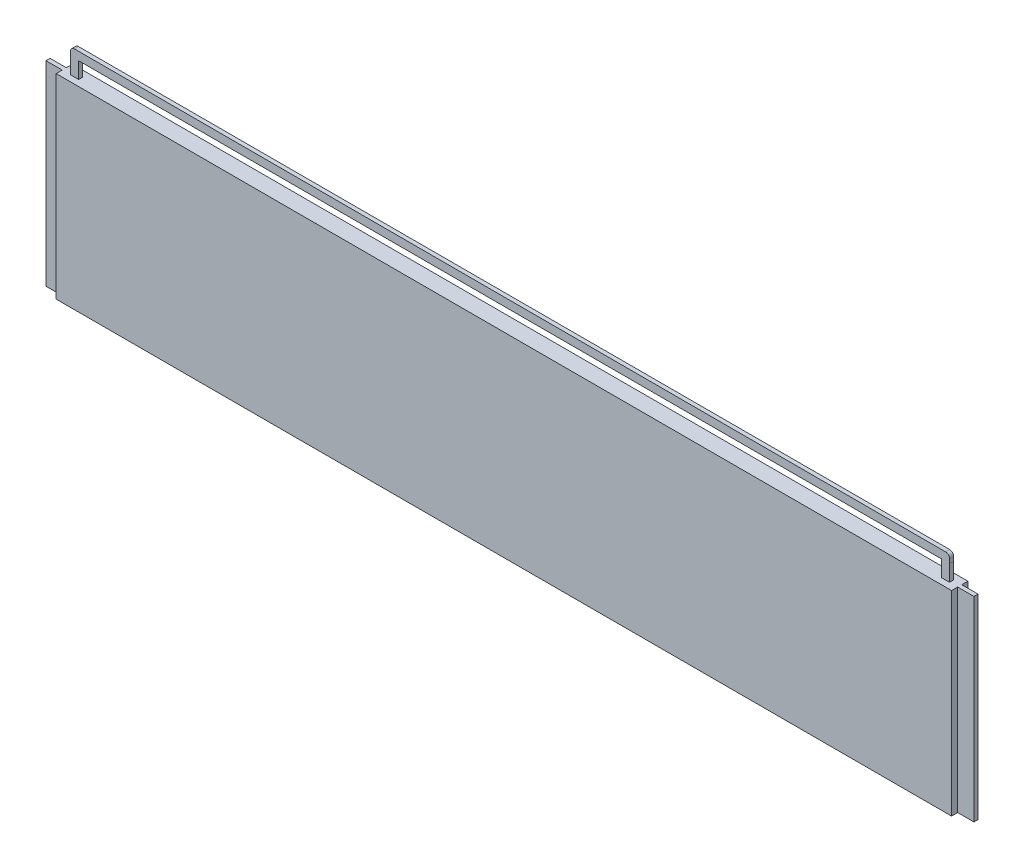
ISO-10303-21;
HEADER;
FILE_DESCRIPTION(('STEP AP214'),'2;1');
FILE_NAME('part.step','',(''),(''),'','','');
FILE_SCHEMA(('AUTOMOTIVE_DESIGN { 1 0 10303 214 1 1 1 1 }'));
ENDSEC;
DATA;
#1=APPLICATION_CONTEXT('core data for automotive mechanical design processes');
#2=APPLICATION_PROTOCOL_DEFINITION('international standard','automotive_design',2000,#1);
#3=PRODUCT_CONTEXT('',#1,'mechanical');
#4=PRODUCT('Part','Part','',(#3));
#5=PRODUCT_RELATED_PRODUCT_CATEGORY('part','',(#4));
#6=PRODUCT_DEFINITION_FORMATION('','',#4);
#7=PRODUCT_DEFINITION_CONTEXT('part definition',#1,'design');
#8=PRODUCT_DEFINITION('design','',#6,#7);
#9=PRODUCT_DEFINITION_SHAPE('','',#8);
#10=(LENGTH_UNIT() NAMED_UNIT(*) SI_UNIT(.MILLI.,.METRE.));
#11=(NAMED_UNIT(*) PLANE_ANGLE_UNIT() SI_UNIT($,.RADIAN.));
#12=(NAMED_UNIT(*) SI_UNIT($,.STERADIAN.) SOLID_ANGLE_UNIT());
#13=UNCERTAINTY_MEASURE_WITH_UNIT(LENGTH_MEASURE(1.E-05),#10,'distance_accuracy_value','');
#14=(GEOMETRIC_REPRESENTATION_CONTEXT(3) GLOBAL_UNCERTAINTY_ASSIGNED_CONTEXT((#13)) GLOBAL_UNIT_ASSIGNED_CONTEXT((#10,
#11,#12)) REPRESENTATION_CONTEXT('',''));
#15=CARTESIAN_POINT('',(0.,0.,0.));
#16=DIRECTION('',(0.,0.,1.));
#17=DIRECTION('',(1.,0.,0.));
#18=AXIS2_PLACEMENT_3D('',#15,#16,#17);
#19=CARTESIAN_POINT('',(55.4278955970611,304.8,15.875));
#20=DIRECTION('',(0.,1.,0.));
#21=DIRECTION('',(0.,0.,1.));
#22=AXIS2_PLACEMENT_3D('',#19,#20,#21);
#23=PLANE('',#22);
#24=DIRECTION('',(0.,0.,-1.));
#25=VECTOR('',#24,1.);
#26=CARTESIAN_POINT('',(-1316.07024248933,304.8,0.));
#27=LINE('',#26,#25);
#28=CARTESIAN_POINT('',(-1316.07024248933,304.8,6.35));
#29=VERTEX_POINT('',#28);
#30=CARTESIAN_POINT('',(-1316.07024248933,304.8,0.));
#31=VERTEX_POINT('',#30);
#32=EDGE_CURVE('E431',#29,#31,#27,.T.);
#33=ORIENTED_EDGE('',*,*,#32,.F.);
#34=DIRECTION('',(1.,0.,0.));
#35=VECTOR('',#34,1.);
#36=CARTESIAN_POINT('',(-1316.07024248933,304.8,6.35));
#37=LINE('',#36,#35);
#38=CARTESIAN_POINT('',(-1328.87210440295,304.8,6.35));
#39=VERTEX_POINT('',#38);
#40=EDGE_CURVE('E396',#39,#29,#37,.T.);
#41=ORIENTED_EDGE('',*,*,#40,.F.);
#42=DIRECTION('',(0.,0.,1.));
#43=VECTOR('',#42,1.);
#44=CARTESIAN_POINT('',(-1328.87210440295,304.8,6.35));
#45=LINE('',#44,#43);
#46=CARTESIAN_POINT('',(-1328.87210440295,304.8,0.));
#47=VERTEX_POINT('',#46);
#48=EDGE_CURVE('E274',#47,#39,#45,.T.);
#49=ORIENTED_EDGE('',*,*,#48,.F.);
#50=DIRECTION('',(-1.,0.,0.));
#51=VECTOR('',#50,1.);
#52=CARTESIAN_POINT('',(-1328.87210440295,304.8,0.));
#53=LINE('',#52,#51);
#54=EDGE_CURVE('E433',#31,#47,#53,.T.);
#55=ORIENTED_EDGE('',*,*,#54,.F.);
#56=EDGE_LOOP('',(#33,#41,#49,#55));
#57=FACE_BOUND('',#56,.T.);
#58=DIRECTION('',(0.,0.,-1.));
#59=VECTOR('',#58,1.);
#60=CARTESIAN_POINT('',(55.4278955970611,304.8,6.35));
#61=LINE('',#60,#59);
#62=CARTESIAN_POINT('',(55.4278955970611,304.8,15.875));
#63=VERTEX_POINT('',#62);
#64=CARTESIAN_POINT('',(55.4278955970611,304.8,6.35));
#65=VERTEX_POINT('',#64);
#66=EDGE_CURVE('E285',#63,#65,#61,.T.);
#67=ORIENTED_EDGE('',*,*,#66,.T.);
#68=DIRECTION('',(1.,0.,0.));
#69=VECTOR('',#68,1.);
#70=CARTESIAN_POINT('',(80.8278955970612,304.8,6.34999999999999));
#71=LINE('',#70,#69);
#72=CARTESIAN_POINT('',(80.8278955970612,304.8,6.34999999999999));
#73=VERTEX_POINT('',#72);
#74=EDGE_CURVE('E288',#65,#73,#71,.T.);
#75=ORIENTED_EDGE('',*,*,#74,.T.);
#76=DIRECTION('',(0.,0.,-1.));
#77=VECTOR('',#76,1.);
#78=CARTESIAN_POINT('',(80.8278955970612,304.8,3.17499999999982));
#79=LINE('',#78,#77);
#80=CARTESIAN_POINT('',(80.8278955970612,304.8,0.));
#81=VERTEX_POINT('',#80);
#82=EDGE_CURVE('E291',#73,#81,#79,.T.);
#83=ORIENTED_EDGE('',*,*,#82,.T.);
#84=DIRECTION('',(-1.,0.,0.));
#85=VECTOR('',#84,1.);
#86=CARTESIAN_POINT('',(80.8278955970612,304.8,0.));
#87=LINE('',#86,#85);
#88=CARTESIAN_POINT('',(55.4278955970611,304.8,0.));
#89=VERTEX_POINT('',#88);
#90=EDGE_CURVE('E293',#81,#89,#87,.T.);
#91=ORIENTED_EDGE('',*,*,#90,.T.);
#92=DIRECTION('',(0.,0.,-1.));
#93=VECTOR('',#92,1.);
#94=CARTESIAN_POINT('',(55.4278955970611,304.8,-9.52500000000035));
#95=LINE('',#94,#93);
#96=CARTESIAN_POINT('',(55.4278955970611,304.8,-9.52500000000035));
#97=VERTEX_POINT('',#96);
#98=EDGE_CURVE('E295',#89,#97,#95,.T.);
#99=ORIENTED_EDGE('',*,*,#98,.T.);
#100=DIRECTION('',(-1.,0.,0.));
#101=VECTOR('',#100,1.);
#102=CARTESIAN_POINT('',(-1341.57210440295,304.8,-9.525));
#103=LINE('',#102,#101);
#104=CARTESIAN_POINT('',(-1341.57210440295,304.8,-9.525));
#105=VERTEX_POINT('',#104);
#106=EDGE_CURVE('E297',#97,#105,#103,.T.);
#107=ORIENTED_EDGE('',*,*,#106,.T.);
#108=DIRECTION('',(0.,0.,1.));
#109=VECTOR('',#108,1.);
#110=CARTESIAN_POINT('',(-1341.57210440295,304.8,-9.525));
#111=LINE('',#110,#109);
#112=CARTESIAN_POINT('',(-1341.57210440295,304.8,0.));
#113=VERTEX_POINT('',#112);
#114=EDGE_CURVE('E299',#105,#113,#111,.T.);
#115=ORIENTED_EDGE('',*,*,#114,.T.);
#116=DIRECTION('',(-1.,0.,0.));
#117=VECTOR('',#116,1.);
#118=CARTESIAN_POINT('',(-1366.97210440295,304.8,0.));
#119=LINE('',#118,#117);
#120=CARTESIAN_POINT('',(-1366.97210440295,304.8,0.));
#121=VERTEX_POINT('',#120);
#122=EDGE_CURVE('E301',#113,#121,#119,.T.);
#123=ORIENTED_EDGE('',*,*,#122,.T.);
#124=DIRECTION('',(0.,0.,1.));
#125=VECTOR('',#124,1.);
#126=CARTESIAN_POINT('',(-1366.97210440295,304.8,3.175));
#127=LINE('',#126,#125);
#128=CARTESIAN_POINT('',(-1366.97210440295,304.8,6.35));
#129=VERTEX_POINT('',#128);
#130=EDGE_CURVE('E303',#121,#129,#127,.T.);
#131=ORIENTED_EDGE('',*,*,#130,.T.);
#132=DIRECTION('',(1.,0.,0.));
#133=VECTOR('',#132,1.);
#134=CARTESIAN_POINT('',(-1366.97210440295,304.8,6.35));
#135=LINE('',#134,#133);
#136=CARTESIAN_POINT('',(-1341.57210440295,304.8,6.35));
#137=VERTEX_POINT('',#136);
#138=EDGE_CURVE('E305',#129,#137,#135,.T.);
#139=ORIENTED_EDGE('',*,*,#138,.T.);
#140=DIRECTION('',(0.,0.,1.));
#141=VECTOR('',#140,1.);
#142=CARTESIAN_POINT('',(-1341.57210440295,304.8,6.35));
#143=LINE('',#142,#141);
#144=CARTESIAN_POINT('',(-1341.57210440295,304.8,15.875));
#145=VERTEX_POINT('',#144);
#146=EDGE_CURVE('E307',#137,#145,#143,.T.);
#147=ORIENTED_EDGE('',*,*,#146,.T.);
#148=DIRECTION('',(1.,0.,0.));
#149=VECTOR('',#148,1.);
#150=CARTESIAN_POINT('',(-1341.57210440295,304.8,15.875));
#151=LINE('',#150,#149);
#152=EDGE_CURVE('E309',#145,#63,#151,.T.);
#153=ORIENTED_EDGE('',*,*,#152,.T.);
#154=EDGE_LOOP('',(#67,#75,#83,#91,#99,#107,#115,#123,#131,#139,#147,#153));
#155=FACE_BOUND('',#154,.T.);
#156=DIRECTION('',(0.,0.,-1.));
#157=VECTOR('',#156,1.);
#158=CARTESIAN_POINT('',(42.7278955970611,304.8,6.35));
#159=LINE('',#158,#157);
#160=CARTESIAN_POINT('',(42.7278955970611,304.8,6.35));
#161=VERTEX_POINT('',#160);
#162=CARTESIAN_POINT('',(42.7278955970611,304.8,0.));
#163=VERTEX_POINT('',#162);
#164=EDGE_CURVE('E387',#161,#163,#159,.T.);
#165=ORIENTED_EDGE('',*,*,#164,.F.);
#166=DIRECTION('',(1.,0.,0.));
#167=VECTOR('',#166,1.);
#168=CARTESIAN_POINT('',(30.0278955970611,304.8,6.35));
#169=LINE('',#168,#167);
#170=CARTESIAN_POINT('',(30.0278955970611,304.8,6.35));
#171=VERTEX_POINT('',#170);
#172=EDGE_CURVE('E204',#171,#161,#169,.T.);
#173=ORIENTED_EDGE('',*,*,#172,.F.);
#174=DIRECTION('',(0.,0.,1.));
#175=VECTOR('',#174,1.);
#176=CARTESIAN_POINT('',(30.0278955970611,304.8,0.));
#177=LINE('',#176,#175);
#178=CARTESIAN_POINT('',(30.0278955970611,304.8,0.));
#179=VERTEX_POINT('',#178);
#180=EDGE_CURVE('E392',#179,#171,#177,.T.);
#181=ORIENTED_EDGE('',*,*,#180,.F.);
#182=DIRECTION('',(-1.,0.,0.));
#183=VECTOR('',#182,1.);
#184=CARTESIAN_POINT('',(42.7278955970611,304.8,0.));
#185=LINE('',#184,#183);
#186=EDGE_CURVE('E389',#163,#179,#185,.T.);
#187=ORIENTED_EDGE('',*,*,#186,.F.);
#188=EDGE_LOOP('',(#165,#173,#181,#187));
#189=FACE_BOUND('',#188,.T.);
#190=ADVANCED_FACE('F34',(#57,#155,#189),#23,.T.);
#191=CARTESIAN_POINT('',(55.4278955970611,304.8,6.35));
#192=DIRECTION('',(-1.,0.,0.));
#193=DIRECTION('',(0.,0.,1.));
#194=AXIS2_PLACEMENT_3D('',#191,#192,#193);
#195=PLANE('',#194);
#196=DIRECTION('',(0.,0.,-1.));
#197=VECTOR('',#196,1.);
#198=CARTESIAN_POINT('',(55.4278955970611,0.,6.35));
#199=LINE('',#198,#197);
#200=CARTESIAN_POINT('',(55.4278955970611,0.,15.875));
#201=VERTEX_POINT('',#200);
#202=CARTESIAN_POINT('',(55.4278955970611,0.,6.35));
#203=VERTEX_POINT('',#202);
#204=EDGE_CURVE('E312',#201,#203,#199,.T.);
#205=ORIENTED_EDGE('',*,*,#204,.T.);
#206=DIRECTION('',(0.,-1.,0.));
#207=VECTOR('',#206,1.);
#208=CARTESIAN_POINT('',(55.4278955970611,304.8,6.35));
#209=LINE('',#208,#207);
#210=EDGE_CURVE('E249',#65,#203,#209,.T.);
#211=ORIENTED_EDGE('',*,*,#210,.F.);
#212=ORIENTED_EDGE('',*,*,#66,.F.);
#213=DIRECTION('',(0.,-1.,0.));
#214=VECTOR('',#213,1.);
#215=CARTESIAN_POINT('',(55.4278955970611,304.8,15.875));
#216=LINE('',#215,#214);
#217=EDGE_CURVE('E311',#63,#201,#216,.T.);
#218=ORIENTED_EDGE('',*,*,#217,.T.);
#219=EDGE_LOOP('',(#205,#211,#212,#218));
#220=FACE_BOUND('',#219,.T.);
#221=ADVANCED_FACE('F436',(#220),#195,.F.);
#222=CARTESIAN_POINT('',(80.8278955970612,304.8,6.34999999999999));
#223=DIRECTION('',(0.,0.,-1.));
#224=DIRECTION('',(-1.,0.,0.));
#225=AXIS2_PLACEMENT_3D('',#222,#223,#224);
#226=PLANE('',#225);
#227=DIRECTION('',(1.,0.,0.));
#228=VECTOR('',#227,1.);
#229=CARTESIAN_POINT('',(80.8278955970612,0.,6.34999999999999));
#230=LINE('',#229,#228);
#231=CARTESIAN_POINT('',(80.8278955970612,0.,6.34999999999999));
#232=VERTEX_POINT('',#231);
#233=EDGE_CURVE('E315',#203,#232,#230,.T.);
#234=ORIENTED_EDGE('',*,*,#233,.T.);
#235=DIRECTION('',(0.,-1.,0.));
#236=VECTOR('',#235,1.);
#237=CARTESIAN_POINT('',(80.8278955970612,304.8,6.34999999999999));
#238=LINE('',#237,#236);
#239=EDGE_CURVE('E253',#73,#232,#238,.T.);
#240=ORIENTED_EDGE('',*,*,#239,.F.);
#241=ORIENTED_EDGE('',*,*,#74,.F.);
#242=ORIENTED_EDGE('',*,*,#210,.T.);
#243=EDGE_LOOP('',(#234,#240,#241,#242));
#244=FACE_BOUND('',#243,.T.);
#245=ADVANCED_FACE('F446',(#244),#226,.F.);
#246=CARTESIAN_POINT('',(80.8278955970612,304.8,3.17499999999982));
#247=DIRECTION('',(-1.,0.,0.));
#248=DIRECTION('',(0.,0.,1.));
#249=AXIS2_PLACEMENT_3D('',#246,#247,#248);
#250=PLANE('',#249);
#251=DIRECTION('',(0.,0.,-1.));
#252=VECTOR('',#251,1.);
#253=CARTESIAN_POINT('',(80.8278955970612,0.,3.17499999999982));
#254=LINE('',#253,#252);
#255=CARTESIAN_POINT('',(80.8278955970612,0.,0.));
#256=VERTEX_POINT('',#255);
#257=EDGE_CURVE('E319',#232,#256,#254,.T.);
#258=ORIENTED_EDGE('',*,*,#257,.T.);
#259=DIRECTION('',(0.,-1.,0.));
#260=VECTOR('',#259,1.);
#261=CARTESIAN_POINT('',(80.8278955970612,304.8,0.));
#262=LINE('',#261,#260);
#263=EDGE_CURVE('E365',#81,#256,#262,.T.);
#264=ORIENTED_EDGE('',*,*,#263,.F.);
#265=ORIENTED_EDGE('',*,*,#82,.F.);
#266=ORIENTED_EDGE('',*,*,#239,.T.);
#267=EDGE_LOOP('',(#258,#264,#265,#266));
#268=FACE_BOUND('',#267,.T.);
#269=ADVANCED_FACE('F450',(#268),#250,.F.);
#270=CARTESIAN_POINT('',(80.8278955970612,304.8,0.));
#271=DIRECTION('',(0.,0.,1.));
#272=DIRECTION('',(1.,0.,0.));
#273=AXIS2_PLACEMENT_3D('',#270,#271,#272);
#274=PLANE('',#273);
#275=DIRECTION('',(-1.,0.,0.));
#276=VECTOR('',#275,1.);
#277=CARTESIAN_POINT('',(80.8278955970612,0.,0.));
#278=LINE('',#277,#276);
#279=CARTESIAN_POINT('',(55.4278955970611,0.,0.));
#280=VERTEX_POINT('',#279);
#281=EDGE_CURVE('E321',#256,#280,#278,.T.);
#282=ORIENTED_EDGE('',*,*,#281,.T.);
#283=DIRECTION('',(0.,-1.,0.));
#284=VECTOR('',#283,1.);
#285=CARTESIAN_POINT('',(55.4278955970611,304.8,0.));
#286=LINE('',#285,#284);
#287=EDGE_CURVE('E362',#89,#280,#286,.T.);
#288=ORIENTED_EDGE('',*,*,#287,.F.);
#289=ORIENTED_EDGE('',*,*,#90,.F.);
#290=ORIENTED_EDGE('',*,*,#263,.T.);
#291=EDGE_LOOP('',(#282,#288,#289,#290));
#292=FACE_BOUND('',#291,.T.);
#293=ADVANCED_FACE('F456',(#292),#274,.F.);
#294=CARTESIAN_POINT('',(55.4278955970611,304.8,-9.52500000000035));
#295=DIRECTION('',(-1.,0.,0.));
#296=DIRECTION('',(0.,0.,1.));
#297=AXIS2_PLACEMENT_3D('',#294,#295,#296);
#298=PLANE('',#297);
#299=DIRECTION('',(0.,0.,-1.));
#300=VECTOR('',#299,1.);
#301=CARTESIAN_POINT('',(55.4278955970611,0.,-9.52500000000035));
#302=LINE('',#301,#300);
#303=CARTESIAN_POINT('',(55.4278955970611,0.,-9.52500000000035));
#304=VERTEX_POINT('',#303);
#305=EDGE_CURVE('E323',#280,#304,#302,.T.);
#306=ORIENTED_EDGE('',*,*,#305,.T.);
#307=DIRECTION('',(0.,-1.,0.));
#308=VECTOR('',#307,1.);
#309=CARTESIAN_POINT('',(55.4278955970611,304.8,-9.52500000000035));
#310=LINE('',#309,#308);
#311=EDGE_CURVE('E359',#97,#304,#310,.T.);
#312=ORIENTED_EDGE('',*,*,#311,.F.);
#313=ORIENTED_EDGE('',*,*,#98,.F.);
#314=ORIENTED_EDGE('',*,*,#287,.T.);
#315=EDGE_LOOP('',(#306,#312,#313,#314));
#316=FACE_BOUND('',#315,.T.);
#317=ADVANCED_FACE('F460',(#316),#298,.F.);
#318=CARTESIAN_POINT('',(-1341.57210440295,304.8,-9.525));
#319=DIRECTION('',(0.,0.,1.));
#320=DIRECTION('',(1.,0.,0.));
#321=AXIS2_PLACEMENT_3D('',#318,#319,#320);
#322=PLANE('',#321);
#323=DIRECTION('',(-1.,0.,0.));
#324=VECTOR('',#323,1.);
#325=CARTESIAN_POINT('',(-1341.57210440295,0.,-9.525));
#326=LINE('',#325,#324);
#327=CARTESIAN_POINT('',(-1341.57210440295,0.,-9.525));
#328=VERTEX_POINT('',#327);
#329=EDGE_CURVE('E325',#304,#328,#326,.T.);
#330=ORIENTED_EDGE('',*,*,#329,.T.);
#331=DIRECTION('',(0.,-1.,0.));
#332=VECTOR('',#331,1.);
#333=CARTESIAN_POINT('',(-1341.57210440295,304.8,-9.525));
#334=LINE('',#333,#332);
#335=EDGE_CURVE('E356',#105,#328,#334,.T.);
#336=ORIENTED_EDGE('',*,*,#335,.F.);
#337=ORIENTED_EDGE('',*,*,#106,.F.);
#338=ORIENTED_EDGE('',*,*,#311,.T.);
#339=EDGE_LOOP('',(#330,#336,#337,#338));
#340=FACE_BOUND('',#339,.T.);
#341=ADVANCED_FACE('F465',(#340),#322,.F.);
#342=CARTESIAN_POINT('',(-1341.57210440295,304.8,-9.525));
#343=DIRECTION('',(1.,0.,0.));
#344=DIRECTION('',(0.,0.,-1.));
#345=AXIS2_PLACEMENT_3D('',#342,#343,#344);
#346=PLANE('',#345);
#347=DIRECTION('',(0.,0.,1.));
#348=VECTOR('',#347,1.);
#349=CARTESIAN_POINT('',(-1341.57210440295,0.,-9.525));
#350=LINE('',#349,#348);
#351=CARTESIAN_POINT('',(-1341.57210440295,0.,0.));
#352=VERTEX_POINT('',#351);
#353=EDGE_CURVE('E327',#328,#352,#350,.T.);
#354=ORIENTED_EDGE('',*,*,#353,.T.);
#355=DIRECTION('',(0.,-1.,0.));
#356=VECTOR('',#355,1.);
#357=CARTESIAN_POINT('',(-1341.57210440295,304.8,0.));
#358=LINE('',#357,#356);
#359=EDGE_CURVE('E353',#113,#352,#358,.T.);
#360=ORIENTED_EDGE('',*,*,#359,.F.);
#361=ORIENTED_EDGE('',*,*,#114,.F.);
#362=ORIENTED_EDGE('',*,*,#335,.T.);
#363=EDGE_LOOP('',(#354,#360,#361,#362));
#364=FACE_BOUND('',#363,.T.);
#365=ADVANCED_FACE('F471',(#364),#346,.F.);
#366=CARTESIAN_POINT('',(-1366.97210440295,304.8,0.));
#367=DIRECTION('',(0.,0.,1.));
#368=DIRECTION('',(1.,0.,0.));
#369=AXIS2_PLACEMENT_3D('',#366,#367,#368);
#370=PLANE('',#369);
#371=DIRECTION('',(-1.,0.,0.));
#372=VECTOR('',#371,1.);
#373=CARTESIAN_POINT('',(-1366.97210440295,0.,0.));
#374=LINE('',#373,#372);
#375=CARTESIAN_POINT('',(-1366.97210440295,0.,0.));
#376=VERTEX_POINT('',#375);
#377=EDGE_CURVE('E329',#352,#376,#374,.T.);
#378=ORIENTED_EDGE('',*,*,#377,.T.);
#379=DIRECTION('',(0.,-1.,0.));
#380=VECTOR('',#379,1.);
#381=CARTESIAN_POINT('',(-1366.97210440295,304.8,0.));
#382=LINE('',#381,#380);
#383=EDGE_CURVE('E350',#121,#376,#382,.T.);
#384=ORIENTED_EDGE('',*,*,#383,.F.);
#385=ORIENTED_EDGE('',*,*,#122,.F.);
#386=ORIENTED_EDGE('',*,*,#359,.T.);
#387=EDGE_LOOP('',(#378,#384,#385,#386));
#388=FACE_BOUND('',#387,.T.);
#389=ADVANCED_FACE('F475',(#388),#370,.F.);
#390=CARTESIAN_POINT('',(-1366.97210440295,304.8,3.175));
#391=DIRECTION('',(1.,0.,0.));
#392=DIRECTION('',(0.,0.,-1.));
#393=AXIS2_PLACEMENT_3D('',#390,#391,#392);
#394=PLANE('',#393);
#395=DIRECTION('',(0.,0.,1.));
#396=VECTOR('',#395,1.);
#397=CARTESIAN_POINT('',(-1366.97210440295,0.,3.175));
#398=LINE('',#397,#396);
#399=CARTESIAN_POINT('',(-1366.97210440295,0.,6.35));
#400=VERTEX_POINT('',#399);
#401=EDGE_CURVE('E332',#376,#400,#398,.T.);
#402=ORIENTED_EDGE('',*,*,#401,.T.);
#403=DIRECTION('',(0.,-1.,0.));
#404=VECTOR('',#403,1.);
#405=CARTESIAN_POINT('',(-1366.97210440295,304.8,6.35));
#406=LINE('',#405,#404);
#407=EDGE_CURVE('E347',#129,#400,#406,.T.);
#408=ORIENTED_EDGE('',*,*,#407,.F.);
#409=ORIENTED_EDGE('',*,*,#130,.F.);
#410=ORIENTED_EDGE('',*,*,#383,.T.);
#411=EDGE_LOOP('',(#402,#408,#409,#410));
#412=FACE_BOUND('',#411,.T.);
#413=ADVANCED_FACE('F479',(#412),#394,.F.);
#414=CARTESIAN_POINT('',(-1366.97210440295,304.8,6.35));
#415=DIRECTION('',(0.,0.,-1.));
#416=DIRECTION('',(-1.,0.,0.));
#417=AXIS2_PLACEMENT_3D('',#414,#415,#416);
#418=PLANE('',#417);
#419=DIRECTION('',(1.,0.,0.));
#420=VECTOR('',#419,1.);
#421=CARTESIAN_POINT('',(-1366.97210440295,0.,6.35));
#422=LINE('',#421,#420);
#423=CARTESIAN_POINT('',(-1341.57210440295,0.,6.35));
#424=VERTEX_POINT('',#423);
#425=EDGE_CURVE('E334',#400,#424,#422,.T.);
#426=ORIENTED_EDGE('',*,*,#425,.T.);
#427=DIRECTION('',(0.,-1.,0.));
#428=VECTOR('',#427,1.);
#429=CARTESIAN_POINT('',(-1341.57210440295,304.8,6.35));
#430=LINE('',#429,#428);
#431=EDGE_CURVE('E344',#137,#424,#430,.T.);
#432=ORIENTED_EDGE('',*,*,#431,.F.);
#433=ORIENTED_EDGE('',*,*,#138,.F.);
#434=ORIENTED_EDGE('',*,*,#407,.T.);
#435=EDGE_LOOP('',(#426,#432,#433,#434));
#436=FACE_BOUND('',#435,.T.);
#437=ADVANCED_FACE('F485',(#436),#418,.F.);
#438=CARTESIAN_POINT('',(-1341.57210440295,304.8,6.35));
#439=DIRECTION('',(1.,0.,0.));
#440=DIRECTION('',(0.,0.,-1.));
#441=AXIS2_PLACEMENT_3D('',#438,#439,#440);
#442=PLANE('',#441);
#443=DIRECTION('',(0.,0.,1.));
#444=VECTOR('',#443,1.);
#445=CARTESIAN_POINT('',(-1341.57210440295,0.,6.35));
#446=LINE('',#445,#444);
#447=CARTESIAN_POINT('',(-1341.57210440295,0.,15.875));
#448=VERTEX_POINT('',#447);
#449=EDGE_CURVE('E336',#424,#448,#446,.T.);
#450=ORIENTED_EDGE('',*,*,#449,.T.);
#451=DIRECTION('',(0.,-1.,0.));
#452=VECTOR('',#451,1.);
#453=CARTESIAN_POINT('',(-1341.57210440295,304.8,15.875));
#454=LINE('',#453,#452);
#455=EDGE_CURVE('E341',#145,#448,#454,.T.);
#456=ORIENTED_EDGE('',*,*,#455,.F.);
#457=ORIENTED_EDGE('',*,*,#146,.F.);
#458=ORIENTED_EDGE('',*,*,#431,.T.);
#459=EDGE_LOOP('',(#450,#456,#457,#458));
#460=FACE_BOUND('',#459,.T.);
#461=ADVANCED_FACE('F489',(#460),#442,.F.);
#462=CARTESIAN_POINT('',(-1341.57210440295,304.8,15.875));
#463=DIRECTION('',(0.,0.,-1.));
#464=DIRECTION('',(-1.,0.,0.));
#465=AXIS2_PLACEMENT_3D('',#462,#463,#464);
#466=PLANE('',#465);
#467=DIRECTION('',(1.,0.,0.));
#468=VECTOR('',#467,1.);
#469=CARTESIAN_POINT('',(-1341.57210440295,0.,15.875));
#470=LINE('',#469,#468);
#471=EDGE_CURVE('E289',#448,#201,#470,.T.);
#472=ORIENTED_EDGE('',*,*,#471,.T.);
#473=ORIENTED_EDGE('',*,*,#217,.F.);
#474=ORIENTED_EDGE('',*,*,#152,.F.);
#475=ORIENTED_EDGE('',*,*,#455,.T.);
#476=EDGE_LOOP('',(#472,#473,#474,#475));
#477=FACE_BOUND('',#476,.T.);
#478=ADVANCED_FACE('F492',(#477),#466,.F.);
#479=CARTESIAN_POINT('',(55.4278955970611,0.,15.875));
#480=DIRECTION('',(0.,1.,0.));
#481=DIRECTION('',(0.,0.,1.));
#482=AXIS2_PLACEMENT_3D('',#479,#480,#481);
#483=PLANE('',#482);
#484=ORIENTED_EDGE('',*,*,#204,.F.);
#485=ORIENTED_EDGE('',*,*,#471,.F.);
#486=ORIENTED_EDGE('',*,*,#449,.F.);
#487=ORIENTED_EDGE('',*,*,#425,.F.);
#488=ORIENTED_EDGE('',*,*,#401,.F.);
#489=ORIENTED_EDGE('',*,*,#377,.F.);
#490=ORIENTED_EDGE('',*,*,#353,.F.);
#491=ORIENTED_EDGE('',*,*,#329,.F.);
#492=ORIENTED_EDGE('',*,*,#305,.F.);
#493=ORIENTED_EDGE('',*,*,#281,.F.);
#494=ORIENTED_EDGE('',*,*,#257,.F.);
#495=ORIENTED_EDGE('',*,*,#233,.F.);
#496=EDGE_LOOP('',(#484,#485,#486,#487,#488,#489,#490,#491,#492,#493,#494,#495));
#497=FACE_BOUND('',#496,.T.);
#498=ADVANCED_FACE('F494',(#497),#483,.F.);
#499=CARTESIAN_POINT('',(-1316.07024248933,330.2,6.35));
#500=DIRECTION('',(0.,0.,-1.));
#501=DIRECTION('',(-1.,0.,0.));
#502=AXIS2_PLACEMENT_3D('',#499,#500,#501);
#503=PLANE('',#502);
#504=DIRECTION('',(1.,0.,0.));
#505=VECTOR('',#504,1.);
#506=CARTESIAN_POINT('',(-1328.87210440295,342.9,6.35));
#507=LINE('',#506,#505);
#508=CARTESIAN_POINT('',(-1322.52210440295,342.9,6.35));
#509=VERTEX_POINT('',#508);
#510=CARTESIAN_POINT('',(36.5372738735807,342.9,6.35));
#511=VERTEX_POINT('',#510);
#512=EDGE_CURVE('E224',#509,#511,#507,.T.);
#513=ORIENTED_EDGE('',*,*,#512,.F.);
#514=CARTESIAN_POINT('',(-1322.52210440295,336.55,6.35));
#515=DIRECTION('',(0.,0.,-1.));
#516=DIRECTION('',(-1.,0.,0.));
#517=AXIS2_PLACEMENT_3D('',#514,#515,#516);
#518=CIRCLE('',#517,6.35);
#519=CARTESIAN_POINT('',(-1328.87210440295,336.55,6.35));
#520=VERTEX_POINT('',#519);
#521=EDGE_CURVE('E260',#509,#520,#518,.F.);
#522=ORIENTED_EDGE('',*,*,#521,.T.);
#523=DIRECTION('',(0.,-1.,0.));
#524=VECTOR('',#523,1.);
#525=CARTESIAN_POINT('',(-1328.87210440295,330.2,6.35));
#526=LINE('',#525,#524);
#527=EDGE_CURVE('E270',#520,#39,#526,.T.);
#528=ORIENTED_EDGE('',*,*,#527,.T.);
#529=ORIENTED_EDGE('',*,*,#40,.T.);
#530=DIRECTION('',(0.,-1.,0.));
#531=VECTOR('',#530,1.);
#532=CARTESIAN_POINT('',(-1316.07024248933,330.2,6.35));
#533=LINE('',#532,#531);
#534=CARTESIAN_POINT('',(-1316.07024248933,330.2,6.35));
#535=VERTEX_POINT('',#534);
#536=EDGE_CURVE('E316',#535,#29,#533,.T.);
#537=ORIENTED_EDGE('',*,*,#536,.F.);
#538=DIRECTION('',(1.,0.,0.));
#539=VECTOR('',#538,1.);
#540=CARTESIAN_POINT('',(-1328.87210440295,330.2,6.35));
#541=LINE('',#540,#539);
#542=CARTESIAN_POINT('',(30.027895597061,330.2,6.35));
#543=VERTEX_POINT('',#542);
#544=EDGE_CURVE('E216',#535,#543,#541,.T.);
#545=ORIENTED_EDGE('',*,*,#544,.T.);
#546=DIRECTION('',(0.,-1.,0.));
#547=VECTOR('',#546,1.);
#548=CARTESIAN_POINT('',(30.0278955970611,330.2,6.35));
#549=LINE('',#548,#547);
#550=EDGE_CURVE('E370',#543,#171,#549,.T.);
#551=ORIENTED_EDGE('',*,*,#550,.T.);
#552=ORIENTED_EDGE('',*,*,#172,.T.);
#553=DIRECTION('',(0.,-1.,0.));
#554=VECTOR('',#553,1.);
#555=CARTESIAN_POINT('',(42.7278955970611,330.2,6.35));
#556=LINE('',#555,#554);
#557=CARTESIAN_POINT('',(42.7278955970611,330.2,6.35));
#558=VERTEX_POINT('',#557);
#559=EDGE_CURVE('E213',#558,#161,#556,.T.);
#560=ORIENTED_EDGE('',*,*,#559,.F.);
#561=CARTESIAN_POINT('',(42.8872738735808,330.2,6.35));
#562=VERTEX_POINT('',#561);
#563=EDGE_CURVE('E209',#558,#562,#541,.T.);
#564=ORIENTED_EDGE('',*,*,#563,.T.);
#565=DIRECTION('',(0.,-1.,0.));
#566=VECTOR('',#565,1.);
#567=CARTESIAN_POINT('',(42.8872738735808,342.9,6.35));
#568=LINE('',#567,#566);
#569=CARTESIAN_POINT('',(42.8872738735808,336.55,6.35));
#570=VERTEX_POINT('',#569);
#571=EDGE_CURVE('E195',#570,#562,#568,.T.);
#572=ORIENTED_EDGE('',*,*,#571,.F.);
#573=CARTESIAN_POINT('',(36.5372738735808,336.55,6.35000000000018));
#574=DIRECTION('',(0.,0.,-1.));
#575=DIRECTION('',(-1.,0.,0.));
#576=AXIS2_PLACEMENT_3D('',#573,#574,#575);
#577=CIRCLE('',#576,6.35);
#578=EDGE_CURVE('E248',#570,#511,#577,.F.);
#579=ORIENTED_EDGE('',*,*,#578,.T.);
#580=EDGE_LOOP('',(#513,#522,#528,#529,#537,#545,#551,#552,#560,#564,#572,#579));
#581=FACE_BOUND('',#580,.T.);
#582=ADVANCED_FACE('F211',(#581),#503,.F.);
#583=CARTESIAN_POINT('',(-1316.07024248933,330.2,0.));
#584=DIRECTION('',(-1.,0.,0.));
#585=DIRECTION('',(0.,0.,1.));
#586=AXIS2_PLACEMENT_3D('',#583,#584,#585);
#587=PLANE('',#586);
#588=ORIENTED_EDGE('',*,*,#32,.T.);
#589=DIRECTION('',(0.,-1.,0.));
#590=VECTOR('',#589,1.);
#591=CARTESIAN_POINT('',(-1316.07024248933,330.2,0.));
#592=LINE('',#591,#590);
#593=CARTESIAN_POINT('',(-1316.07024248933,330.2,0.));
#594=VERTEX_POINT('',#593);
#595=EDGE_CURVE('E278',#594,#31,#592,.T.);
#596=ORIENTED_EDGE('',*,*,#595,.F.);
#597=DIRECTION('',(0.,0.,-1.));
#598=VECTOR('',#597,1.);
#599=CARTESIAN_POINT('',(-1316.07024248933,330.2,0.));
#600=LINE('',#599,#598);
#601=EDGE_CURVE('E276',#535,#594,#600,.T.);
#602=ORIENTED_EDGE('',*,*,#601,.F.);
#603=ORIENTED_EDGE('',*,*,#536,.T.);
#604=EDGE_LOOP('',(#588,#596,#602,#603));
#605=FACE_BOUND('',#604,.T.);
#606=ADVANCED_FACE('F429',(#605),#587,.F.);
#607=CARTESIAN_POINT('',(-1328.87210440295,330.2,0.));
#608=DIRECTION('',(0.,0.,1.));
#609=DIRECTION('',(1.,0.,0.));
#610=AXIS2_PLACEMENT_3D('',#607,#608,#609);
#611=PLANE('',#610);
#612=DIRECTION('',(0.,-1.,0.));
#613=VECTOR('',#612,1.);
#614=CARTESIAN_POINT('',(-1328.87210440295,330.2,0.));
#615=LINE('',#614,#613);
#616=CARTESIAN_POINT('',(-1328.87210440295,336.55,0.));
#617=VERTEX_POINT('',#616);
#618=EDGE_CURVE('E266',#617,#47,#615,.T.);
#619=ORIENTED_EDGE('',*,*,#618,.F.);
#620=CARTESIAN_POINT('',(-1322.52210440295,336.55,0.));
#621=DIRECTION('',(0.,0.,1.));
#622=DIRECTION('',(1.,0.,0.));
#623=AXIS2_PLACEMENT_3D('',#620,#621,#622);
#624=CIRCLE('',#623,6.35);
#625=CARTESIAN_POINT('',(-1322.52210440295,342.9,0.));
#626=VERTEX_POINT('',#625);
#627=EDGE_CURVE('E42',#617,#626,#624,.F.);
#628=ORIENTED_EDGE('',*,*,#627,.T.);
#629=DIRECTION('',(-1.,0.,0.));
#630=VECTOR('',#629,1.);
#631=CARTESIAN_POINT('',(-1328.87210440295,342.9,0.));
#632=LINE('',#631,#630);
#633=CARTESIAN_POINT('',(36.5372738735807,342.9,0.));
#634=VERTEX_POINT('',#633);
#635=EDGE_CURVE('E221',#634,#626,#632,.T.);
#636=ORIENTED_EDGE('',*,*,#635,.F.);
#637=CARTESIAN_POINT('',(36.5372738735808,336.55,0.));
#638=DIRECTION('',(0.,0.,1.));
#639=DIRECTION('',(1.,0.,0.));
#640=AXIS2_PLACEMENT_3D('',#637,#638,#639);
#641=CIRCLE('',#640,6.35);
#642=CARTESIAN_POINT('',(42.8872738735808,336.55,0.));
#643=VERTEX_POINT('',#642);
#644=EDGE_CURVE('E49',#634,#643,#641,.F.);
#645=ORIENTED_EDGE('',*,*,#644,.T.);
#646=DIRECTION('',(0.,-1.,0.));
#647=VECTOR('',#646,1.);
#648=CARTESIAN_POINT('',(42.8872738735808,342.9,0.));
#649=LINE('',#648,#647);
#650=CARTESIAN_POINT('',(42.8872738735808,330.2,0.));
#651=VERTEX_POINT('',#650);
#652=EDGE_CURVE('E205',#643,#651,#649,.T.);
#653=ORIENTED_EDGE('',*,*,#652,.T.);
#654=DIRECTION('',(-1.,0.,0.));
#655=VECTOR('',#654,1.);
#656=CARTESIAN_POINT('',(-1328.87210440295,330.2,0.));
#657=LINE('',#656,#655);
#658=CARTESIAN_POINT('',(42.7278955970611,330.2,0.));
#659=VERTEX_POINT('',#658);
#660=EDGE_CURVE('E217',#651,#659,#657,.T.);
#661=ORIENTED_EDGE('',*,*,#660,.T.);
#662=DIRECTION('',(0.,-1.,0.));
#663=VECTOR('',#662,1.);
#664=CARTESIAN_POINT('',(42.7278955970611,330.2,0.));
#665=LINE('',#664,#663);
#666=EDGE_CURVE('E410',#659,#163,#665,.T.);
#667=ORIENTED_EDGE('',*,*,#666,.T.);
#668=ORIENTED_EDGE('',*,*,#186,.T.);
#669=DIRECTION('',(0.,-1.,0.));
#670=VECTOR('',#669,1.);
#671=CARTESIAN_POINT('',(30.0278955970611,330.2,0.));
#672=LINE('',#671,#670);
#673=CARTESIAN_POINT('',(30.0278955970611,330.2,0.));
#674=VERTEX_POINT('',#673);
#675=EDGE_CURVE('E373',#674,#179,#672,.T.);
#676=ORIENTED_EDGE('',*,*,#675,.F.);
#677=EDGE_CURVE('E234',#674,#594,#657,.T.);
#678=ORIENTED_EDGE('',*,*,#677,.T.);
#679=ORIENTED_EDGE('',*,*,#595,.T.);
#680=ORIENTED_EDGE('',*,*,#54,.T.);
#681=EDGE_LOOP('',(#619,#628,#636,#645,#653,#661,#667,#668,#676,#678,#679,#680));
#682=FACE_BOUND('',#681,.T.);
#683=ADVANCED_FACE('F264',(#682),#611,.F.);
#684=CARTESIAN_POINT('',(-1328.87210440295,330.2,6.35));
#685=DIRECTION('',(1.,0.,0.));
#686=DIRECTION('',(0.,0.,-1.));
#687=AXIS2_PLACEMENT_3D('',#684,#685,#686);
#688=PLANE('',#687);
#689=ORIENTED_EDGE('',*,*,#527,.F.);
#690=DIRECTION('',(0.,0.,1.));
#691=VECTOR('',#690,1.);
#692=CARTESIAN_POINT('',(-1328.87210440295,336.55,6.35));
#693=LINE('',#692,#691);
#694=EDGE_CURVE('E57',#520,#617,#693,.F.);
#695=ORIENTED_EDGE('',*,*,#694,.T.);
#696=ORIENTED_EDGE('',*,*,#618,.T.);
#697=ORIENTED_EDGE('',*,*,#48,.T.);
#698=EDGE_LOOP('',(#689,#695,#696,#697));
#699=FACE_BOUND('',#698,.T.);
#700=ADVANCED_FACE('F272',(#699),#688,.F.);
#701=CARTESIAN_POINT('',(42.7278955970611,330.2,6.35));
#702=DIRECTION('',(-1.,0.,0.));
#703=DIRECTION('',(0.,0.,1.));
#704=AXIS2_PLACEMENT_3D('',#701,#702,#703);
#705=PLANE('',#704);
#706=ORIENTED_EDGE('',*,*,#164,.T.);
#707=ORIENTED_EDGE('',*,*,#666,.F.);
#708=DIRECTION('',(0.,0.,-1.));
#709=VECTOR('',#708,1.);
#710=CARTESIAN_POINT('',(42.7278955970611,330.2,6.35));
#711=LINE('',#710,#709);
#712=EDGE_CURVE('E380',#558,#659,#711,.T.);
#713=ORIENTED_EDGE('',*,*,#712,.F.);
#714=ORIENTED_EDGE('',*,*,#559,.T.);
#715=EDGE_LOOP('',(#706,#707,#713,#714));
#716=FACE_BOUND('',#715,.T.);
#717=ADVANCED_FACE('F541',(#716),#705,.F.);
#718=CARTESIAN_POINT('',(30.0278955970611,330.2,0.));
#719=DIRECTION('',(1.,0.,0.));
#720=DIRECTION('',(0.,0.,-1.));
#721=AXIS2_PLACEMENT_3D('',#718,#719,#720);
#722=PLANE('',#721);
#723=ORIENTED_EDGE('',*,*,#180,.T.);
#724=ORIENTED_EDGE('',*,*,#550,.F.);
#725=DIRECTION('',(0.,0.,1.));
#726=VECTOR('',#725,1.);
#727=CARTESIAN_POINT('',(30.0278955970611,330.2,0.));
#728=LINE('',#727,#726);
#729=EDGE_CURVE('E374',#674,#543,#728,.T.);
#730=ORIENTED_EDGE('',*,*,#729,.F.);
#731=ORIENTED_EDGE('',*,*,#675,.T.);
#732=EDGE_LOOP('',(#723,#724,#730,#731));
#733=FACE_BOUND('',#732,.T.);
#734=ADVANCED_FACE('F423',(#733),#722,.F.);
#735=CARTESIAN_POINT('',(42.8872738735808,330.2,0.));
#736=DIRECTION('',(0.,-1.,0.));
#737=DIRECTION('',(0.,0.,-1.));
#738=AXIS2_PLACEMENT_3D('',#735,#736,#737);
#739=PLANE('',#738);
#740=ORIENTED_EDGE('',*,*,#563,.F.);
#741=ORIENTED_EDGE('',*,*,#712,.T.);
#742=ORIENTED_EDGE('',*,*,#660,.F.);
#743=DIRECTION('',(0.,0.,-1.));
#744=VECTOR('',#743,1.);
#745=CARTESIAN_POINT('',(42.8872738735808,330.2,0.));
#746=LINE('',#745,#744);
#747=EDGE_CURVE('E199',#562,#651,#746,.T.);
#748=ORIENTED_EDGE('',*,*,#747,.F.);
#749=EDGE_LOOP('',(#740,#741,#742,#748));
#750=FACE_BOUND('',#749,.T.);
#751=ADVANCED_FACE('F219',(#750),#739,.T.);
#752=CARTESIAN_POINT('',(42.8872738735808,342.9,0.));
#753=DIRECTION('',(-1.,0.,0.));
#754=DIRECTION('',(0.,0.,1.));
#755=AXIS2_PLACEMENT_3D('',#752,#753,#754);
#756=PLANE('',#755);
#757=ORIENTED_EDGE('',*,*,#652,.F.);
#758=DIRECTION('',(0.,0.,-1.));
#759=VECTOR('',#758,1.);
#760=CARTESIAN_POINT('',(42.8872738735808,336.55,0.));
#761=LINE('',#760,#759);
#762=EDGE_CURVE('E11',#643,#570,#761,.F.);
#763=ORIENTED_EDGE('',*,*,#762,.T.);
#764=ORIENTED_EDGE('',*,*,#571,.T.);
#765=ORIENTED_EDGE('',*,*,#747,.T.);
#766=EDGE_LOOP('',(#757,#763,#764,#765));
#767=FACE_BOUND('',#766,.T.);
#768=ADVANCED_FACE('F197',(#767),#756,.F.);
#769=CARTESIAN_POINT('',(42.8872738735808,342.9,0.));
#770=DIRECTION('',(0.,-1.,0.));
#771=DIRECTION('',(0.,0.,-1.));
#772=AXIS2_PLACEMENT_3D('',#769,#770,#771);
#773=PLANE('',#772);
#774=ORIENTED_EDGE('',*,*,#635,.T.);
#775=DIRECTION('',(0.,0.,1.));
#776=VECTOR('',#775,1.);
#777=CARTESIAN_POINT('',(-1322.52210440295,342.9,0.));
#778=LINE('',#777,#776);
#779=EDGE_CURVE('E246',#626,#509,#778,.T.);
#780=ORIENTED_EDGE('',*,*,#779,.T.);
#781=ORIENTED_EDGE('',*,*,#512,.T.);
#782=DIRECTION('',(0.,0.,-1.));
#783=VECTOR('',#782,1.);
#784=CARTESIAN_POINT('',(36.5372738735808,342.9,0.));
#785=LINE('',#784,#783);
#786=EDGE_CURVE('E244',#511,#634,#785,.T.);
#787=ORIENTED_EDGE('',*,*,#786,.T.);
#788=EDGE_LOOP('',(#774,#780,#781,#787));
#789=FACE_BOUND('',#788,.T.);
#790=ADVANCED_FACE('F243',(#789),#773,.F.);
#791=ORIENTED_EDGE('',*,*,#544,.F.);
#792=ORIENTED_EDGE('',*,*,#601,.T.);
#793=ORIENTED_EDGE('',*,*,#677,.F.);
#794=ORIENTED_EDGE('',*,*,#729,.T.);
#795=EDGE_LOOP('',(#791,#792,#793,#794));
#796=FACE_BOUND('',#795,.T.);
#797=ADVANCED_FACE('F427',(#796),#739,.T.);
#798=CARTESIAN_POINT('',(-1322.52210440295,336.55,0.));
#799=DIRECTION('',(0.,0.,1.));
#800=DIRECTION('',(1.,0.,0.));
#801=AXIS2_PLACEMENT_3D('',#798,#799,#800);
#802=CYLINDRICAL_SURFACE('',#801,6.35);
#803=ORIENTED_EDGE('',*,*,#627,.F.);
#804=ORIENTED_EDGE('',*,*,#694,.F.);
#805=ORIENTED_EDGE('',*,*,#521,.F.);
#806=ORIENTED_EDGE('',*,*,#779,.F.);
#807=EDGE_LOOP('',(#803,#804,#805,#806));
#808=FACE_BOUND('',#807,.T.);
#809=ADVANCED_FACE('F268',(#808),#802,.T.);
#810=CARTESIAN_POINT('',(36.5372738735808,336.55,0.));
#811=DIRECTION('',(0.,0.,-1.));
#812=DIRECTION('',(-1.,0.,0.));
#813=AXIS2_PLACEMENT_3D('',#810,#811,#812);
#814=CYLINDRICAL_SURFACE('',#813,6.35);
#815=ORIENTED_EDGE('',*,*,#578,.F.);
#816=ORIENTED_EDGE('',*,*,#762,.F.);
#817=ORIENTED_EDGE('',*,*,#644,.F.);
#818=ORIENTED_EDGE('',*,*,#786,.F.);
#819=EDGE_LOOP('',(#815,#816,#817,#818));
#820=FACE_BOUND('',#819,.T.);
#821=ADVANCED_FACE('F36',(#820),#814,.T.);
#822=CLOSED_SHELL('',(#190,#221,#245,#269,#293,#317,#341,#365,#389,#413,#437,#461,#478,#498,
#582,#606,#683,#700,#717,#734,#751,#768,#790,#797,#809,#821));
#823=MANIFOLD_SOLID_BREP('B2',#822);
#824=ADVANCED_BREP_SHAPE_REPRESENTATION('',(#18,#823),#14);
#825=SHAPE_DEFINITION_REPRESENTATION(#9,#824);
ENDSEC;
END-ISO-10303-21;
